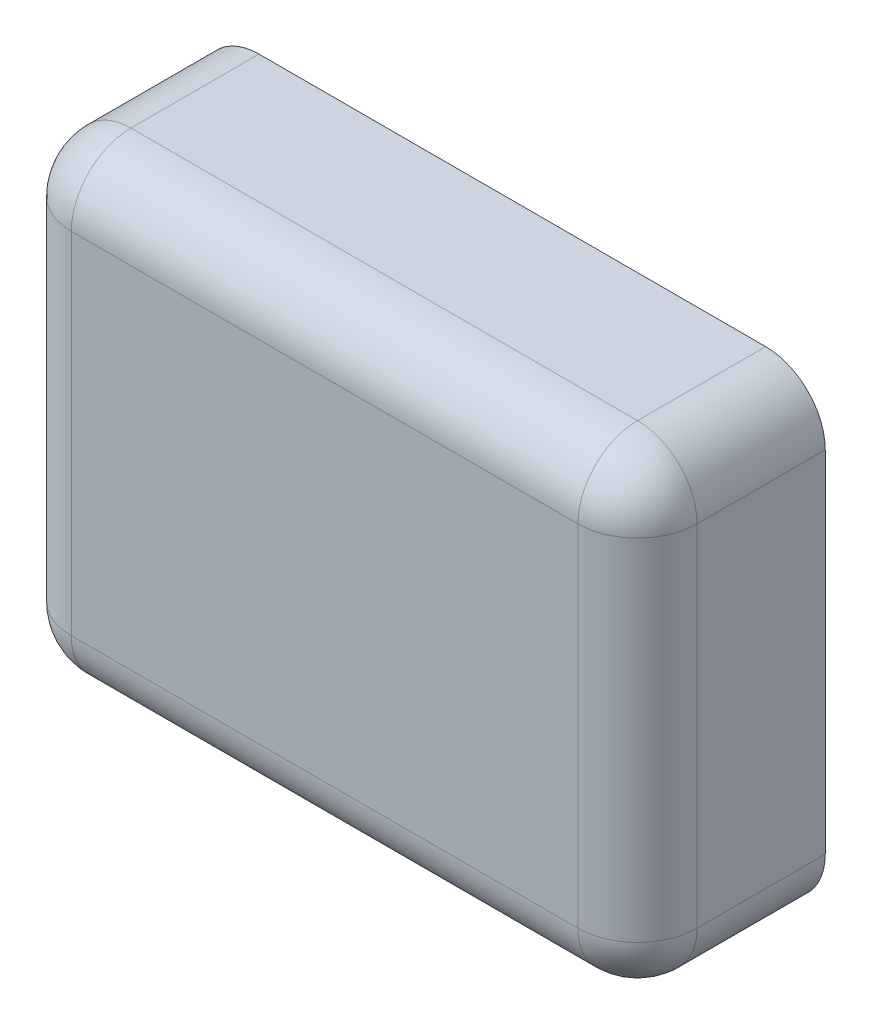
ISO-10303-21;
HEADER;
FILE_DESCRIPTION(('STEP AP214'),'2;1');
FILE_NAME('part.step','',(''),(''),'','','');
FILE_SCHEMA(('AUTOMOTIVE_DESIGN { 1 0 10303 214 1 1 1 1 }'));
ENDSEC;
DATA;
#1=APPLICATION_CONTEXT('core data for automotive mechanical design processes');
#2=APPLICATION_PROTOCOL_DEFINITION('international standard','automotive_design',2000,#1);
#3=PRODUCT_CONTEXT('',#1,'mechanical');
#4=PRODUCT('Part','Part','',(#3));
#5=PRODUCT_RELATED_PRODUCT_CATEGORY('part','',(#4));
#6=PRODUCT_DEFINITION_FORMATION('','',#4);
#7=PRODUCT_DEFINITION_CONTEXT('part definition',#1,'design');
#8=PRODUCT_DEFINITION('design','',#6,#7);
#9=PRODUCT_DEFINITION_SHAPE('','',#8);
#10=(LENGTH_UNIT() NAMED_UNIT(*) SI_UNIT(.MILLI.,.METRE.));
#11=(NAMED_UNIT(*) PLANE_ANGLE_UNIT() SI_UNIT($,.RADIAN.));
#12=(NAMED_UNIT(*) SI_UNIT($,.STERADIAN.) SOLID_ANGLE_UNIT());
#13=UNCERTAINTY_MEASURE_WITH_UNIT(LENGTH_MEASURE(1.E-05),#10,'distance_accuracy_value','');
#14=(GEOMETRIC_REPRESENTATION_CONTEXT(3) GLOBAL_UNCERTAINTY_ASSIGNED_CONTEXT((#13)) GLOBAL_UNIT_ASSIGNED_CONTEXT((#10,
#11,#12)) REPRESENTATION_CONTEXT('',''));
#15=CARTESIAN_POINT('',(0.,0.,0.));
#16=DIRECTION('',(0.,0.,1.));
#17=DIRECTION('',(1.,0.,0.));
#18=AXIS2_PLACEMENT_3D('',#15,#16,#17);
#19=CARTESIAN_POINT('',(0.,-150.,60.));
#20=DIRECTION('',(0.,0.,1.));
#21=DIRECTION('',(1.,0.,0.));
#22=AXIS2_PLACEMENT_3D('',#19,#20,#21);
#23=PLANE('',#22);
#24=DIRECTION('',(0.,1.,0.));
#25=VECTOR('',#24,1.);
#26=CARTESIAN_POINT('',(19.05,-150.,60.));
#27=LINE('',#26,#25);
#28=CARTESIAN_POINT('',(19.05,-130.95,60.));
#29=VERTEX_POINT('',#28);
#30=CARTESIAN_POINT('',(19.05,-19.0500000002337,60.));
#31=VERTEX_POINT('',#30);
#32=EDGE_CURVE('E115',#29,#31,#27,.T.);
#33=ORIENTED_EDGE('',*,*,#32,.F.);
#34=DIRECTION('',(-1.,0.,0.));
#35=VECTOR('',#34,1.);
#36=CARTESIAN_POINT('',(0.,-130.95,60.));
#37=LINE('',#36,#35);
#38=CARTESIAN_POINT('',(180.95,-130.95,60.));
#39=VERTEX_POINT('',#38);
#40=EDGE_CURVE('E112',#39,#29,#37,.T.);
#41=ORIENTED_EDGE('',*,*,#40,.F.);
#42=DIRECTION('',(0.,-1.,0.));
#43=VECTOR('',#42,1.);
#44=CARTESIAN_POINT('',(180.95,-150.,60.));
#45=LINE('',#44,#43);
#46=CARTESIAN_POINT('',(180.95,-19.05,60.));
#47=VERTEX_POINT('',#46);
#48=EDGE_CURVE('E101',#47,#39,#45,.T.);
#49=ORIENTED_EDGE('',*,*,#48,.F.);
#50=DIRECTION('',(1.,0.,0.));
#51=VECTOR('',#50,1.);
#52=CARTESIAN_POINT('',(0.,-19.05,60.));
#53=LINE('',#52,#51);
#54=EDGE_CURVE('E155',#31,#47,#53,.T.);
#55=ORIENTED_EDGE('',*,*,#54,.F.);
#56=EDGE_LOOP('',(#33,#41,#49,#55));
#57=FACE_BOUND('',#56,.T.);
#58=ADVANCED_FACE('F17',(#57),#23,.T.);
#59=CARTESIAN_POINT('',(180.95,-130.95,40.95));
#60=DIRECTION('',(1.,0.,0.));
#61=DIRECTION('',(0.,0.,-1.));
#62=AXIS2_PLACEMENT_3D('',#59,#60,#61);
#63=SPHERICAL_SURFACE('',#62,19.05);
#64=CARTESIAN_POINT('',(180.95,-130.95,40.95));
#65=DIRECTION('',(0.,0.,-1.));
#66=DIRECTION('',(-1.,0.,0.));
#67=AXIS2_PLACEMENT_3D('',#64,#65,#66);
#68=CIRCLE('',#67,19.05);
#69=CARTESIAN_POINT('',(200.,-130.95,40.95));
#70=VERTEX_POINT('',#69);
#71=CARTESIAN_POINT('',(180.95,-150.,40.95));
#72=VERTEX_POINT('',#71);
#73=EDGE_CURVE('E117',#70,#72,#68,.T.);
#74=ORIENTED_EDGE('',*,*,#73,.F.);
#75=CARTESIAN_POINT('',(180.95,-130.95,40.95));
#76=DIRECTION('',(0.,-1.,0.));
#77=DIRECTION('',(1.,0.,0.));
#78=AXIS2_PLACEMENT_3D('',#75,#76,#77);
#79=CIRCLE('',#78,19.05);
#80=EDGE_CURVE('E106',#39,#70,#79,.F.);
#81=ORIENTED_EDGE('',*,*,#80,.F.);
#82=CARTESIAN_POINT('',(180.95,-130.95,40.95));
#83=DIRECTION('',(-1.,0.,0.));
#84=DIRECTION('',(0.,0.,1.));
#85=AXIS2_PLACEMENT_3D('',#82,#83,#84);
#86=CIRCLE('',#85,19.05);
#87=EDGE_CURVE('E118',#72,#39,#86,.T.);
#88=ORIENTED_EDGE('',*,*,#87,.F.);
#89=EDGE_LOOP('',(#74,#81,#88));
#90=FACE_BOUND('',#89,.T.);
#91=ADVANCED_FACE('F125',(#90),#63,.T.);
#92=CARTESIAN_POINT('',(180.95,-150.,40.95));
#93=DIRECTION('',(0.,-1.,0.));
#94=DIRECTION('',(1.,0.,0.));
#95=AXIS2_PLACEMENT_3D('',#92,#93,#94);
#96=CYLINDRICAL_SURFACE('',#95,19.05);
#97=CARTESIAN_POINT('',(180.95,-19.05,40.95));
#98=DIRECTION('',(0.,-1.,0.));
#99=DIRECTION('',(1.,0.,0.));
#100=AXIS2_PLACEMENT_3D('',#97,#98,#99);
#101=CIRCLE('',#100,19.05);
#102=CARTESIAN_POINT('',(200.,-19.05,40.95));
#103=VERTEX_POINT('',#102);
#104=EDGE_CURVE('E108',#47,#103,#101,.F.);
#105=ORIENTED_EDGE('',*,*,#104,.F.);
#106=ORIENTED_EDGE('',*,*,#48,.T.);
#107=ORIENTED_EDGE('',*,*,#80,.T.);
#108=DIRECTION('',(0.,-1.,0.));
#109=VECTOR('',#108,1.);
#110=CARTESIAN_POINT('',(200.,0.,40.95));
#111=LINE('',#110,#109);
#112=EDGE_CURVE('E170',#70,#103,#111,.F.);
#113=ORIENTED_EDGE('',*,*,#112,.T.);
#114=EDGE_LOOP('',(#105,#106,#107,#113));
#115=FACE_BOUND('',#114,.T.);
#116=ADVANCED_FACE('F103',(#115),#96,.T.);
#117=CARTESIAN_POINT('',(180.95,-19.05,40.95));
#118=DIRECTION('',(1.,0.,0.));
#119=DIRECTION('',(0.,0.,-1.));
#120=AXIS2_PLACEMENT_3D('',#117,#118,#119);
#121=SPHERICAL_SURFACE('',#120,19.05);
#122=CARTESIAN_POINT('',(180.95,-19.05,40.95));
#123=DIRECTION('',(0.,0.,-1.));
#124=DIRECTION('',(-1.,0.,0.));
#125=AXIS2_PLACEMENT_3D('',#122,#123,#124);
#126=CIRCLE('',#125,19.05);
#127=CARTESIAN_POINT('',(180.95,0.,40.95));
#128=VERTEX_POINT('',#127);
#129=EDGE_CURVE('E167',#128,#103,#126,.T.);
#130=ORIENTED_EDGE('',*,*,#129,.F.);
#131=CARTESIAN_POINT('',(180.95,-19.05,40.95));
#132=DIRECTION('',(1.,0.,0.));
#133=DIRECTION('',(0.,0.,-1.));
#134=AXIS2_PLACEMENT_3D('',#131,#132,#133);
#135=CIRCLE('',#134,19.05);
#136=EDGE_CURVE('E151',#47,#128,#135,.F.);
#137=ORIENTED_EDGE('',*,*,#136,.F.);
#138=ORIENTED_EDGE('',*,*,#104,.T.);
#139=EDGE_LOOP('',(#130,#137,#138));
#140=FACE_BOUND('',#139,.T.);
#141=ADVANCED_FACE('F140',(#140),#121,.T.);
#142=CARTESIAN_POINT('',(0.,-19.05,40.95));
#143=DIRECTION('',(1.,0.,0.));
#144=DIRECTION('',(0.,0.,-1.));
#145=AXIS2_PLACEMENT_3D('',#142,#143,#144);
#146=CYLINDRICAL_SURFACE('',#145,19.05);
#147=CARTESIAN_POINT('',(19.05,-19.05,40.95));
#148=DIRECTION('',(1.,0.,0.));
#149=DIRECTION('',(0.,0.,-1.));
#150=AXIS2_PLACEMENT_3D('',#147,#148,#149);
#151=CIRCLE('',#150,19.05);
#152=CARTESIAN_POINT('',(19.05,0.,40.95));
#153=VERTEX_POINT('',#152);
#154=EDGE_CURVE('E159',#31,#153,#151,.F.);
#155=ORIENTED_EDGE('',*,*,#154,.F.);
#156=ORIENTED_EDGE('',*,*,#54,.T.);
#157=ORIENTED_EDGE('',*,*,#136,.T.);
#158=DIRECTION('',(1.,0.,0.));
#159=VECTOR('',#158,1.);
#160=CARTESIAN_POINT('',(0.,0.,40.95));
#161=LINE('',#160,#159);
#162=EDGE_CURVE('E283',#128,#153,#161,.F.);
#163=ORIENTED_EDGE('',*,*,#162,.T.);
#164=EDGE_LOOP('',(#155,#156,#157,#163));
#165=FACE_BOUND('',#164,.T.);
#166=ADVANCED_FACE('F144',(#165),#146,.T.);
#167=CARTESIAN_POINT('',(19.05,-19.05,40.95));
#168=DIRECTION('',(1.,0.,0.));
#169=DIRECTION('',(0.,0.,-1.));
#170=AXIS2_PLACEMENT_3D('',#167,#168,#169);
#171=SPHERICAL_SURFACE('',#170,19.05);
#172=CARTESIAN_POINT('',(19.05,-19.05,40.95));
#173=DIRECTION('',(0.,1.,0.));
#174=DIRECTION('',(-1.,0.,0.));
#175=AXIS2_PLACEMENT_3D('',#172,#173,#174);
#176=CIRCLE('',#175,19.05);
#177=CARTESIAN_POINT('',(0.,-19.05,40.95));
#178=VERTEX_POINT('',#177);
#179=EDGE_CURVE('E232',#31,#178,#176,.F.);
#180=ORIENTED_EDGE('',*,*,#179,.F.);
#181=ORIENTED_EDGE('',*,*,#154,.T.);
#182=CARTESIAN_POINT('',(19.05,-19.05,40.95));
#183=DIRECTION('',(0.,0.,-1.));
#184=DIRECTION('',(-1.,0.,0.));
#185=AXIS2_PLACEMENT_3D('',#182,#183,#184);
#186=CIRCLE('',#185,19.05);
#187=EDGE_CURVE('E278',#178,#153,#186,.T.);
#188=ORIENTED_EDGE('',*,*,#187,.F.);
#189=EDGE_LOOP('',(#180,#181,#188));
#190=FACE_BOUND('',#189,.T.);
#191=ADVANCED_FACE('F219',(#190),#171,.T.);
#192=CARTESIAN_POINT('',(19.05,-150.,40.95));
#193=DIRECTION('',(0.,1.,0.));
#194=DIRECTION('',(-1.,0.,0.));
#195=AXIS2_PLACEMENT_3D('',#192,#193,#194);
#196=CYLINDRICAL_SURFACE('',#195,19.05);
#197=ORIENTED_EDGE('',*,*,#179,.T.);
#198=DIRECTION('',(0.,1.,0.));
#199=VECTOR('',#198,1.);
#200=CARTESIAN_POINT('',(0.,0.,40.95));
#201=LINE('',#200,#199);
#202=CARTESIAN_POINT('',(0.,-130.95,40.95));
#203=VERTEX_POINT('',#202);
#204=EDGE_CURVE('E188',#178,#203,#201,.F.);
#205=ORIENTED_EDGE('',*,*,#204,.T.);
#206=CARTESIAN_POINT('',(19.05,-130.95,40.95));
#207=DIRECTION('',(0.,-1.,0.));
#208=DIRECTION('',(1.,0.,0.));
#209=AXIS2_PLACEMENT_3D('',#206,#207,#208);
#210=CIRCLE('',#209,19.05);
#211=EDGE_CURVE('E195',#29,#203,#210,.T.);
#212=ORIENTED_EDGE('',*,*,#211,.F.);
#213=ORIENTED_EDGE('',*,*,#32,.T.);
#214=EDGE_LOOP('',(#197,#205,#212,#213));
#215=FACE_BOUND('',#214,.T.);
#216=ADVANCED_FACE('F215',(#215),#196,.T.);
#217=CARTESIAN_POINT('',(19.05,-130.95,40.95));
#218=DIRECTION('',(1.,0.,0.));
#219=DIRECTION('',(0.,0.,-1.));
#220=AXIS2_PLACEMENT_3D('',#217,#218,#219);
#221=SPHERICAL_SURFACE('',#220,19.05);
#222=CARTESIAN_POINT('',(19.05,-130.95,40.95));
#223=DIRECTION('',(-1.,0.,0.));
#224=DIRECTION('',(0.,0.,1.));
#225=AXIS2_PLACEMENT_3D('',#222,#223,#224);
#226=CIRCLE('',#225,19.05);
#227=CARTESIAN_POINT('',(19.05,-150.,40.95));
#228=VERTEX_POINT('',#227);
#229=EDGE_CURVE('E66',#29,#228,#226,.F.);
#230=ORIENTED_EDGE('',*,*,#229,.F.);
#231=ORIENTED_EDGE('',*,*,#211,.T.);
#232=CARTESIAN_POINT('',(19.05,-130.95,40.95));
#233=DIRECTION('',(0.,0.,-1.));
#234=DIRECTION('',(-1.,0.,0.));
#235=AXIS2_PLACEMENT_3D('',#232,#233,#234);
#236=CIRCLE('',#235,19.05);
#237=EDGE_CURVE('E184',#228,#203,#236,.T.);
#238=ORIENTED_EDGE('',*,*,#237,.F.);
#239=EDGE_LOOP('',(#230,#231,#238));
#240=FACE_BOUND('',#239,.T.);
#241=ADVANCED_FACE('F211',(#240),#221,.T.);
#242=CARTESIAN_POINT('',(0.,-130.95,40.95));
#243=DIRECTION('',(-1.,0.,0.));
#244=DIRECTION('',(0.,0.,1.));
#245=AXIS2_PLACEMENT_3D('',#242,#243,#244);
#246=CYLINDRICAL_SURFACE('',#245,19.05);
#247=ORIENTED_EDGE('',*,*,#87,.T.);
#248=ORIENTED_EDGE('',*,*,#40,.T.);
#249=ORIENTED_EDGE('',*,*,#229,.T.);
#250=DIRECTION('',(1.,0.,0.));
#251=VECTOR('',#250,1.);
#252=CARTESIAN_POINT('',(0.,-150.,40.95));
#253=LINE('',#252,#251);
#254=EDGE_CURVE('E122',#228,#72,#253,.T.);
#255=ORIENTED_EDGE('',*,*,#254,.T.);
#256=EDGE_LOOP('',(#247,#248,#249,#255));
#257=FACE_BOUND('',#256,.T.);
#258=ADVANCED_FACE('F121',(#257),#246,.T.);
#259=CARTESIAN_POINT('',(180.95,-130.95,60.));
#260=DIRECTION('',(0.,0.,-1.));
#261=DIRECTION('',(-1.,0.,0.));
#262=AXIS2_PLACEMENT_3D('',#259,#260,#261);
#263=CYLINDRICAL_SURFACE('',#262,19.05);
#264=ORIENTED_EDGE('',*,*,#73,.T.);
#265=DIRECTION('',(0.,0.,1.));
#266=VECTOR('',#265,1.);
#267=CARTESIAN_POINT('',(180.95,-150.,60.));
#268=LINE('',#267,#266);
#269=CARTESIAN_POINT('',(180.95,-150.,0.));
#270=VERTEX_POINT('',#269);
#271=EDGE_CURVE('E263',#72,#270,#268,.F.);
#272=ORIENTED_EDGE('',*,*,#271,.T.);
#273=CARTESIAN_POINT('',(180.95,-130.95,0.));
#274=DIRECTION('',(0.,0.,-1.));
#275=DIRECTION('',(-1.,0.,0.));
#276=AXIS2_PLACEMENT_3D('',#273,#274,#275);
#277=CIRCLE('',#276,19.05);
#278=CARTESIAN_POINT('',(200.,-130.95,0.));
#279=VERTEX_POINT('',#278);
#280=EDGE_CURVE('E20',#270,#279,#277,.F.);
#281=ORIENTED_EDGE('',*,*,#280,.T.);
#282=DIRECTION('',(0.,0.,1.));
#283=VECTOR('',#282,1.);
#284=CARTESIAN_POINT('',(200.,-130.95,60.));
#285=LINE('',#284,#283);
#286=EDGE_CURVE('E172',#279,#70,#285,.T.);
#287=ORIENTED_EDGE('',*,*,#286,.T.);
#288=EDGE_LOOP('',(#264,#272,#281,#287));
#289=FACE_BOUND('',#288,.T.);
#290=ADVANCED_FACE('F312',(#289),#263,.T.);
#291=CARTESIAN_POINT('',(200.,0.,60.));
#292=DIRECTION('',(-1.,0.,0.));
#293=DIRECTION('',(0.,-1.,0.));
#294=AXIS2_PLACEMENT_3D('',#291,#292,#293);
#295=PLANE('',#294);
#296=ORIENTED_EDGE('',*,*,#286,.F.);
#297=DIRECTION('',(0.,1.,0.));
#298=VECTOR('',#297,1.);
#299=CARTESIAN_POINT('',(200.,-150.,0.));
#300=LINE('',#299,#298);
#301=CARTESIAN_POINT('',(200.,-19.05,0.));
#302=VERTEX_POINT('',#301);
#303=EDGE_CURVE('E251',#279,#302,#300,.T.);
#304=ORIENTED_EDGE('',*,*,#303,.T.);
#305=DIRECTION('',(0.,0.,-1.));
#306=VECTOR('',#305,1.);
#307=CARTESIAN_POINT('',(200.,-19.05,60.));
#308=LINE('',#307,#306);
#309=EDGE_CURVE('E169',#103,#302,#308,.T.);
#310=ORIENTED_EDGE('',*,*,#309,.F.);
#311=ORIENTED_EDGE('',*,*,#112,.F.);
#312=EDGE_LOOP('',(#296,#304,#310,#311));
#313=FACE_BOUND('',#312,.T.);
#314=ADVANCED_FACE('F314',(#313),#295,.F.);
#315=CARTESIAN_POINT('',(180.95,-19.05,60.));
#316=DIRECTION('',(0.,0.,-1.));
#317=DIRECTION('',(-1.,0.,0.));
#318=AXIS2_PLACEMENT_3D('',#315,#316,#317);
#319=CYLINDRICAL_SURFACE('',#318,19.05);
#320=ORIENTED_EDGE('',*,*,#129,.T.);
#321=ORIENTED_EDGE('',*,*,#309,.T.);
#322=CARTESIAN_POINT('',(180.95,-19.05,0.));
#323=DIRECTION('',(0.,0.,-1.));
#324=DIRECTION('',(-1.,0.,0.));
#325=AXIS2_PLACEMENT_3D('',#322,#323,#324);
#326=CIRCLE('',#325,19.05);
#327=CARTESIAN_POINT('',(180.95,0.,0.));
#328=VERTEX_POINT('',#327);
#329=EDGE_CURVE('E249',#302,#328,#326,.F.);
#330=ORIENTED_EDGE('',*,*,#329,.T.);
#331=DIRECTION('',(0.,0.,-1.));
#332=VECTOR('',#331,1.);
#333=CARTESIAN_POINT('',(180.95,0.,60.));
#334=LINE('',#333,#332);
#335=EDGE_CURVE('E281',#328,#128,#334,.F.);
#336=ORIENTED_EDGE('',*,*,#335,.T.);
#337=EDGE_LOOP('',(#320,#321,#330,#336));
#338=FACE_BOUND('',#337,.T.);
#339=ADVANCED_FACE('F285',(#338),#319,.T.);
#340=CARTESIAN_POINT('',(0.,0.,60.));
#341=DIRECTION('',(0.,-1.,0.));
#342=DIRECTION('',(0.,0.,-1.));
#343=AXIS2_PLACEMENT_3D('',#340,#341,#342);
#344=PLANE('',#343);
#345=DIRECTION('',(0.,0.,-1.));
#346=VECTOR('',#345,1.);
#347=CARTESIAN_POINT('',(19.05,0.,60.));
#348=LINE('',#347,#346);
#349=CARTESIAN_POINT('',(19.05,0.,0.));
#350=VERTEX_POINT('',#349);
#351=EDGE_CURVE('E274',#153,#350,#348,.T.);
#352=ORIENTED_EDGE('',*,*,#351,.F.);
#353=ORIENTED_EDGE('',*,*,#162,.F.);
#354=ORIENTED_EDGE('',*,*,#335,.F.);
#355=DIRECTION('',(1.,0.,0.));
#356=VECTOR('',#355,1.);
#357=CARTESIAN_POINT('',(0.,0.,0.));
#358=LINE('',#357,#356);
#359=EDGE_CURVE('E248',#328,#350,#358,.F.);
#360=ORIENTED_EDGE('',*,*,#359,.T.);
#361=EDGE_LOOP('',(#352,#353,#354,#360));
#362=FACE_BOUND('',#361,.T.);
#363=ADVANCED_FACE('F293',(#362),#344,.F.);
#364=CARTESIAN_POINT('',(19.05,-19.05,60.));
#365=DIRECTION('',(0.,0.,-1.));
#366=DIRECTION('',(-1.,0.,0.));
#367=AXIS2_PLACEMENT_3D('',#364,#365,#366);
#368=CYLINDRICAL_SURFACE('',#367,19.05);
#369=ORIENTED_EDGE('',*,*,#187,.T.);
#370=ORIENTED_EDGE('',*,*,#351,.T.);
#371=CARTESIAN_POINT('',(19.05,-19.05,0.));
#372=DIRECTION('',(0.,0.,-1.));
#373=DIRECTION('',(-1.,0.,0.));
#374=AXIS2_PLACEMENT_3D('',#371,#372,#373);
#375=CIRCLE('',#374,19.05);
#376=CARTESIAN_POINT('',(0.,-19.05,0.));
#377=VERTEX_POINT('',#376);
#378=EDGE_CURVE('E246',#350,#377,#375,.F.);
#379=ORIENTED_EDGE('',*,*,#378,.T.);
#380=DIRECTION('',(0.,0.,1.));
#381=VECTOR('',#380,1.);
#382=CARTESIAN_POINT('',(0.,-19.05,60.));
#383=LINE('',#382,#381);
#384=EDGE_CURVE('E204',#377,#178,#383,.T.);
#385=ORIENTED_EDGE('',*,*,#384,.T.);
#386=EDGE_LOOP('',(#369,#370,#379,#385));
#387=FACE_BOUND('',#386,.T.);
#388=ADVANCED_FACE('F302',(#387),#368,.T.);
#389=CARTESIAN_POINT('',(0.,0.,60.));
#390=DIRECTION('',(1.,0.,0.));
#391=DIRECTION('',(0.,1.,0.));
#392=AXIS2_PLACEMENT_3D('',#389,#390,#391);
#393=PLANE('',#392);
#394=DIRECTION('',(0.,0.,-1.));
#395=VECTOR('',#394,1.);
#396=CARTESIAN_POINT('',(0.,-130.95,60.));
#397=LINE('',#396,#395);
#398=CARTESIAN_POINT('',(0.,-130.95,0.));
#399=VERTEX_POINT('',#398);
#400=EDGE_CURVE('E187',#203,#399,#397,.T.);
#401=ORIENTED_EDGE('',*,*,#400,.F.);
#402=ORIENTED_EDGE('',*,*,#204,.F.);
#403=ORIENTED_EDGE('',*,*,#384,.F.);
#404=DIRECTION('',(0.,1.,0.));
#405=VECTOR('',#404,1.);
#406=CARTESIAN_POINT('',(0.,-150.,0.));
#407=LINE('',#406,#405);
#408=EDGE_CURVE('E245',#377,#399,#407,.F.);
#409=ORIENTED_EDGE('',*,*,#408,.T.);
#410=EDGE_LOOP('',(#401,#402,#403,#409));
#411=FACE_BOUND('',#410,.T.);
#412=ADVANCED_FACE('F306',(#411),#393,.F.);
#413=CARTESIAN_POINT('',(19.05,-130.95,60.));
#414=DIRECTION('',(0.,0.,-1.));
#415=DIRECTION('',(-1.,0.,0.));
#416=AXIS2_PLACEMENT_3D('',#413,#414,#415);
#417=CYLINDRICAL_SURFACE('',#416,19.05);
#418=ORIENTED_EDGE('',*,*,#237,.T.);
#419=ORIENTED_EDGE('',*,*,#400,.T.);
#420=CARTESIAN_POINT('',(19.05,-130.95,0.));
#421=DIRECTION('',(0.,0.,-1.));
#422=DIRECTION('',(-1.,0.,0.));
#423=AXIS2_PLACEMENT_3D('',#420,#421,#422);
#424=CIRCLE('',#423,19.05);
#425=CARTESIAN_POINT('',(19.05,-150.,0.));
#426=VERTEX_POINT('',#425);
#427=EDGE_CURVE('E26',#399,#426,#424,.F.);
#428=ORIENTED_EDGE('',*,*,#427,.T.);
#429=DIRECTION('',(0.,0.,1.));
#430=VECTOR('',#429,1.);
#431=CARTESIAN_POINT('',(19.05,-150.,60.));
#432=LINE('',#431,#430);
#433=EDGE_CURVE('E34',#426,#228,#432,.T.);
#434=ORIENTED_EDGE('',*,*,#433,.T.);
#435=EDGE_LOOP('',(#418,#419,#428,#434));
#436=FACE_BOUND('',#435,.T.);
#437=ADVANCED_FACE('F309',(#436),#417,.T.);
#438=CARTESIAN_POINT('',(0.,-150.,60.));
#439=DIRECTION('',(0.,1.,0.));
#440=DIRECTION('',(0.,0.,1.));
#441=AXIS2_PLACEMENT_3D('',#438,#439,#440);
#442=PLANE('',#441);
#443=ORIENTED_EDGE('',*,*,#433,.F.);
#444=DIRECTION('',(1.,0.,0.));
#445=VECTOR('',#444,1.);
#446=CARTESIAN_POINT('',(0.,-150.,0.));
#447=LINE('',#446,#445);
#448=EDGE_CURVE('E11',#426,#270,#447,.T.);
#449=ORIENTED_EDGE('',*,*,#448,.T.);
#450=ORIENTED_EDGE('',*,*,#271,.F.);
#451=ORIENTED_EDGE('',*,*,#254,.F.);
#452=EDGE_LOOP('',(#443,#449,#450,#451));
#453=FACE_BOUND('',#452,.T.);
#454=ADVANCED_FACE('F311',(#453),#442,.F.);
#455=CARTESIAN_POINT('',(0.,-150.,0.));
#456=DIRECTION('',(0.,0.,1.));
#457=DIRECTION('',(1.,0.,0.));
#458=AXIS2_PLACEMENT_3D('',#455,#456,#457);
#459=PLANE('',#458);
#460=ORIENTED_EDGE('',*,*,#427,.F.);
#461=ORIENTED_EDGE('',*,*,#408,.F.);
#462=ORIENTED_EDGE('',*,*,#378,.F.);
#463=ORIENTED_EDGE('',*,*,#359,.F.);
#464=ORIENTED_EDGE('',*,*,#329,.F.);
#465=ORIENTED_EDGE('',*,*,#303,.F.);
#466=ORIENTED_EDGE('',*,*,#280,.F.);
#467=ORIENTED_EDGE('',*,*,#448,.F.);
#468=EDGE_LOOP('',(#460,#461,#462,#463,#464,#465,#466,#467));
#469=FACE_BOUND('',#468,.T.);
#470=ADVANCED_FACE('F288',(#469),#459,.F.);
#471=CLOSED_SHELL('',(#58,#91,#116,#141,#166,#191,#216,#241,#258,#290,#314,#339,#363,#388,#412,
#437,#454,#470));
#472=MANIFOLD_SOLID_BREP('B1',#471);
#473=ADVANCED_BREP_SHAPE_REPRESENTATION('',(#18,#472),#14);
#474=SHAPE_DEFINITION_REPRESENTATION(#9,#473);
ENDSEC;
END-ISO-10303-21;
